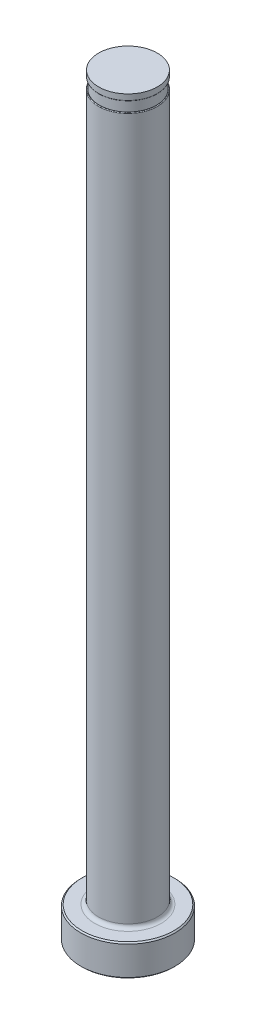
ISO-10303-21;
HEADER;
FILE_DESCRIPTION(('STEP AP214'),'2;1');
FILE_NAME('part.step','',(''),(''),'','','');
FILE_SCHEMA(('AUTOMOTIVE_DESIGN { 1 0 10303 214 1 1 1 1 }'));
ENDSEC;
DATA;
#1=APPLICATION_CONTEXT('core data for automotive mechanical design processes');
#2=APPLICATION_PROTOCOL_DEFINITION('international standard','automotive_design',2000,#1);
#3=PRODUCT_CONTEXT('',#1,'mechanical');
#4=PRODUCT('Part','Part','',(#3));
#5=PRODUCT_RELATED_PRODUCT_CATEGORY('part','',(#4));
#6=PRODUCT_DEFINITION_FORMATION('','',#4);
#7=PRODUCT_DEFINITION_CONTEXT('part definition',#1,'design');
#8=PRODUCT_DEFINITION('design','',#6,#7);
#9=PRODUCT_DEFINITION_SHAPE('','',#8);
#10=(LENGTH_UNIT() NAMED_UNIT(*) SI_UNIT(.MILLI.,.METRE.));
#11=(NAMED_UNIT(*) PLANE_ANGLE_UNIT() SI_UNIT($,.RADIAN.));
#12=(NAMED_UNIT(*) SI_UNIT($,.STERADIAN.) SOLID_ANGLE_UNIT());
#13=UNCERTAINTY_MEASURE_WITH_UNIT(LENGTH_MEASURE(1.E-05),#10,'distance_accuracy_value','');
#14=(GEOMETRIC_REPRESENTATION_CONTEXT(3) GLOBAL_UNCERTAINTY_ASSIGNED_CONTEXT((#13)) GLOBAL_UNIT_ASSIGNED_CONTEXT((#10,
#11,#12)) REPRESENTATION_CONTEXT('',''));
#15=CARTESIAN_POINT('',(0.,0.,0.));
#16=DIRECTION('',(0.,0.,1.));
#17=DIRECTION('',(1.,0.,0.));
#18=AXIS2_PLACEMENT_3D('',#15,#16,#17);
#19=CARTESIAN_POINT('',(-5.95248999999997,151.13,0.));
#20=DIRECTION('',(0.,1.,0.));
#21=DIRECTION('',(0.,0.,1.));
#22=AXIS2_PLACEMENT_3D('',#19,#20,#21);
#23=PLANE('',#22);
#24=CARTESIAN_POINT('',(0.,151.13,0.));
#25=DIRECTION('',(0.,1.,0.));
#26=DIRECTION('',(0.,0.,1.));
#27=AXIS2_PLACEMENT_3D('',#24,#25,#26);
#28=CIRCLE('',#27,5.80643999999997);
#29=CARTESIAN_POINT('',(0.,151.13,5.80643999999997));
#30=VERTEX_POINT('',#29);
#31=EDGE_CURVE('E11',#30,#30,#28,.F.);
#32=ORIENTED_EDGE('',*,*,#31,.T.);
#33=EDGE_LOOP('',(#32));
#34=FACE_BOUND('',#33,.T.);
#35=CARTESIAN_POINT('',(0.,151.13,0.));
#36=DIRECTION('',(0.,1.,0.));
#37=DIRECTION('',(0.,0.,1.));
#38=AXIS2_PLACEMENT_3D('',#35,#36,#37);
#39=CIRCLE('',#38,5.74928999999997);
#40=CARTESIAN_POINT('',(0.,151.13,5.74928999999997));
#41=VERTEX_POINT('',#40);
#42=EDGE_CURVE('E78',#41,#41,#39,.T.);
#43=ORIENTED_EDGE('',*,*,#42,.T.);
#44=EDGE_LOOP('',(#43));
#45=FACE_BOUND('',#44,.T.);
#46=ADVANCED_FACE('F36',(#34,#45),#23,.F.);
#47=CARTESIAN_POINT('',(0.,259.958771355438,0.));
#48=DIRECTION('',(0.,1.,0.));
#49=DIRECTION('',(0.,0.,1.));
#50=AXIS2_PLACEMENT_3D('',#47,#48,#49);
#51=CYLINDRICAL_SURFACE('',#50,5.95248999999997);
#52=DIRECTION('',(0.,1.,0.));
#53=VECTOR('',#52,1.);
#54=CARTESIAN_POINT('',(-5.74928999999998,259.958771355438,-1.5420122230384));
#55=LINE('',#54,#53);
#56=CARTESIAN_POINT('',(-5.74928999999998,148.971,-1.5420122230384));
#57=VERTEX_POINT('',#56);
#58=CARTESIAN_POINT('',(-5.74928999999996,86.614,-1.54201222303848));
#59=VERTEX_POINT('',#58);
#60=EDGE_CURVE('E73',#57,#59,#55,.F.);
#61=ORIENTED_EDGE('',*,*,#60,.F.);
#62=CARTESIAN_POINT('',(0.,148.971,0.));
#63=DIRECTION('',(0.,-1.,0.));
#64=DIRECTION('',(0.,0.,-1.));
#65=AXIS2_PLACEMENT_3D('',#62,#63,#64);
#66=CIRCLE('',#65,5.95248999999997);
#67=CARTESIAN_POINT('',(-5.74928999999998,148.971,1.5420122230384));
#68=VERTEX_POINT('',#67);
#69=EDGE_CURVE('E51',#57,#68,#66,.T.);
#70=ORIENTED_EDGE('',*,*,#69,.T.);
#71=DIRECTION('',(0.,1.,0.));
#72=VECTOR('',#71,1.);
#73=CARTESIAN_POINT('',(-5.74928999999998,259.958771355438,1.5420122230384));
#74=LINE('',#73,#72);
#75=CARTESIAN_POINT('',(-5.74928999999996,86.614,1.54201222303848));
#76=VERTEX_POINT('',#75);
#77=EDGE_CURVE('E84',#76,#68,#74,.T.);
#78=ORIENTED_EDGE('',*,*,#77,.F.);
#79=CARTESIAN_POINT('',(-5.74928999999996,86.614,-1.54201222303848));
#80=CARTESIAN_POINT('',(-5.7492869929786,86.5862208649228,-1.54201697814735));
#81=CARTESIAN_POINT('',(-5.74965505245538,86.5584610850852,-1.54065166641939));
#82=CARTESIAN_POINT('',(-5.75110274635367,86.5032460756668,-1.53524151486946));
#83=CARTESIAN_POINT('',(-5.75218176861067,86.4757906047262,-1.53119898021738));
#84=CARTESIAN_POINT('',(-5.75641075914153,86.3947767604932,-1.51525486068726));
#85=CARTESIAN_POINT('',(-5.76055400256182,86.3419793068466,-1.49953379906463));
#86=CARTESIAN_POINT('',(-5.77092696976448,86.2404513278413,-1.45909687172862));
#87=CARTESIAN_POINT('',(-5.77715061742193,86.191709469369,-1.43440718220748));
#88=CARTESIAN_POINT('',(-5.79098788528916,86.0989780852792,-1.37748193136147));
#89=CARTESIAN_POINT('',(-5.7986047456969,86.0550000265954,-1.34522872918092));
#90=CARTESIAN_POINT('',(-5.8168590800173,85.9601849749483,-1.26430278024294));
#91=CARTESIAN_POINT('',(-5.82772577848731,85.9111387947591,-1.21359133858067));
#92=CARTESIAN_POINT('',(-5.84932001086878,85.8219814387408,-1.10484574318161));
#93=CARTESIAN_POINT('',(-5.86004729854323,85.7818844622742,-1.0468001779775));
#94=CARTESIAN_POINT('',(-5.88390059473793,85.6979339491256,-0.904778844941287));
#95=CARTESIAN_POINT('',(-5.89659263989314,85.6574837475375,-0.818723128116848));
#96=CARTESIAN_POINT('',(-5.91855552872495,85.5905666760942,-0.641010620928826));
#97=CARTESIAN_POINT('',(-5.92782357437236,85.5641112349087,-0.549349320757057));
#98=CARTESIAN_POINT('',(-5.94230780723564,85.5236429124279,-0.360889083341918));
#99=CARTESIAN_POINT('',(-5.94742894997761,85.5099208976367,-0.26402114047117));
#100=CARTESIAN_POINT('',(-5.95288793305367,85.495318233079,-0.0691558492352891));
#101=CARTESIAN_POINT('',(-5.95322242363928,85.4944465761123,0.0288422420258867));
#102=CARTESIAN_POINT('',(-5.94868446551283,85.5065404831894,0.242237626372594));
#103=CARTESIAN_POINT('',(-5.94283113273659,85.5221121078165,0.357477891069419));
#104=CARTESIAN_POINT('',(-5.92492015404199,85.5723022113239,0.583281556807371));
#105=CARTESIAN_POINT('',(-5.91286985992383,85.6068981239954,0.693850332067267));
#106=CARTESIAN_POINT('',(-5.88892429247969,85.6822489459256,0.870563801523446));
#107=CARTESIAN_POINT('',(-5.8782833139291,85.7172292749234,0.939352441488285));
#108=CARTESIAN_POINT('',(-5.85581507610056,85.7974071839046,1.07049428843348));
#109=CARTESIAN_POINT('',(-5.84398982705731,85.8425876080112,1.13285804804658));
#110=CARTESIAN_POINT('',(-5.82307219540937,85.9323208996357,1.23534317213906));
#111=CARTESIAN_POINT('',(-5.81396107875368,85.97474672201,1.27731748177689));
#112=CARTESIAN_POINT('',(-5.79660025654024,86.0659777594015,1.35392068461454));
#113=CARTESIAN_POINT('',(-5.78834968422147,86.1147764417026,1.38855700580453));
#114=CARTESIAN_POINT('',(-5.77487399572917,86.2094137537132,1.4434795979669));
#115=CARTESIAN_POINT('',(-5.76937362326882,86.2543804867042,1.46519744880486));
#116=CARTESIAN_POINT('',(-5.76015985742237,86.3473997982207,1.50101335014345));
#117=CARTESIAN_POINT('',(-5.75644319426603,86.3954465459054,1.51512534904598));
#118=CARTESIAN_POINT('',(-5.75233279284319,86.4722424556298,1.53063311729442));
#119=CARTESIAN_POINT('',(-5.75119737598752,86.500400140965,1.53488770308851));
#120=CARTESIAN_POINT('',(-5.74967384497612,86.5570323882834,1.54058135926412));
#121=CARTESIAN_POINT('',(-5.74928611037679,86.5855071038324,1.54201899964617));
#122=CARTESIAN_POINT('',(-5.74928999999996,86.614,1.54201222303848));
#123=B_SPLINE_CURVE_WITH_KNOTS('',3,(#79,#80,#81,#82,#83,#84,#85,#86,#87,#88,#89,#90,#91,#92,
#93,#94,#95,#96,#97,#98,#99,#100,#101,#102,#103,#104,#105,#106,#107,#108,#109,#110,#111,#112,
#113,#114,#115,#116,#117,#118,#119,#120,#121,#122),.UNSPECIFIED.,.F.,.F.,(4,2,2,2,2,2,2,2,2,2,2,
2,2,2,2,2,2,2,2,2,2,4),(0.,0.0832648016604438,0.166458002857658,0.331100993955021,
0.495267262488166,0.659820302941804,0.872804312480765,1.08612389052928,1.37238232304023,
1.65887416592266,1.95175985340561,2.2448504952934,2.59250114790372,2.93974031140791,
3.17269488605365,3.4052605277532,3.58572381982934,3.76600355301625,3.91610532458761,
4.0659308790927,4.15129340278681,4.23669924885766),.UNSPECIFIED.);
#124=EDGE_CURVE('E81',#59,#76,#123,.T.);
#125=ORIENTED_EDGE('',*,*,#124,.F.);
#126=EDGE_LOOP('',(#61,#70,#78,#125));
#127=FACE_BOUND('',#126,.T.);
#128=CARTESIAN_POINT('',(0.,7.11200000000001,0.));
#129=DIRECTION('',(0.,1.,0.));
#130=DIRECTION('',(0.,0.,1.));
#131=AXIS2_PLACEMENT_3D('',#128,#129,#130);
#132=CIRCLE('',#131,5.95248999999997);
#133=CARTESIAN_POINT('',(0.,7.11200000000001,5.95248999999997));
#134=VERTEX_POINT('',#133);
#135=EDGE_CURVE('E116',#134,#134,#132,.T.);
#136=ORIENTED_EDGE('',*,*,#135,.T.);
#137=EDGE_LOOP('',(#136));
#138=FACE_BOUND('',#137,.T.);
#139=ADVANCED_FACE('F82',(#127,#138),#51,.T.);
#140=CARTESIAN_POINT('',(0.,0.,0.));
#141=DIRECTION('',(0.,-1.,0.));
#142=DIRECTION('',(0.,0.,-1.));
#143=AXIS2_PLACEMENT_3D('',#140,#141,#142);
#144=PLANE('',#143);
#145=CARTESIAN_POINT('',(0.,0.,0.));
#146=DIRECTION('',(0.,-1.,0.));
#147=DIRECTION('',(0.,0.,-1.));
#148=AXIS2_PLACEMENT_3D('',#145,#146,#147);
#149=CIRCLE('',#148,9.271);
#150=CARTESIAN_POINT('',(0.,0.,-9.271));
#151=VERTEX_POINT('',#150);
#152=EDGE_CURVE('E113',#151,#151,#149,.T.);
#153=ORIENTED_EDGE('',*,*,#152,.T.);
#154=EDGE_LOOP('',(#153));
#155=FACE_BOUND('',#154,.T.);
#156=ADVANCED_FACE('F192',(#155),#144,.T.);
#157=CARTESIAN_POINT('',(0.,259.958771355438,0.));
#158=DIRECTION('',(0.,1.,0.));
#159=DIRECTION('',(0.,0.,1.));
#160=AXIS2_PLACEMENT_3D('',#157,#158,#159);
#161=CYLINDRICAL_SURFACE('',#160,9.52499999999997);
#162=CARTESIAN_POINT('',(0.,6.09600000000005,0.));
#163=DIRECTION('',(0.,1.,0.));
#164=DIRECTION('',(0.,0.,1.));
#165=AXIS2_PLACEMENT_3D('',#162,#163,#164);
#166=CIRCLE('',#165,9.52499999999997);
#167=CARTESIAN_POINT('',(0.,6.09600000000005,9.52499999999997));
#168=VERTEX_POINT('',#167);
#169=EDGE_CURVE('E110',#168,#168,#166,.F.);
#170=ORIENTED_EDGE('',*,*,#169,.T.);
#171=EDGE_LOOP('',(#170));
#172=FACE_BOUND('',#171,.T.);
#173=CARTESIAN_POINT('',(0.,0.253999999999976,0.));
#174=DIRECTION('',(0.,-1.,0.));
#175=DIRECTION('',(0.,0.,-1.));
#176=AXIS2_PLACEMENT_3D('',#173,#174,#175);
#177=CIRCLE('',#176,9.52499999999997);
#178=CARTESIAN_POINT('',(0.,0.253999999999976,-9.52499999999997));
#179=VERTEX_POINT('',#178);
#180=EDGE_CURVE('E107',#179,#179,#177,.F.);
#181=ORIENTED_EDGE('',*,*,#180,.T.);
#182=EDGE_LOOP('',(#181));
#183=FACE_BOUND('',#182,.T.);
#184=ADVANCED_FACE('F195',(#172,#183),#161,.T.);
#185=CARTESIAN_POINT('',(-9.52499999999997,6.35,0.));
#186=DIRECTION('',(0.,1.,0.));
#187=DIRECTION('',(0.,0.,1.));
#188=AXIS2_PLACEMENT_3D('',#185,#186,#187);
#189=PLANE('',#188);
#190=CARTESIAN_POINT('',(0.,6.35,0.));
#191=DIRECTION('',(0.,1.,0.));
#192=DIRECTION('',(0.,0.,1.));
#193=AXIS2_PLACEMENT_3D('',#190,#191,#192);
#194=CIRCLE('',#193,6.71448999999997);
#195=CARTESIAN_POINT('',(0.,6.35,6.71448999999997));
#196=VERTEX_POINT('',#195);
#197=EDGE_CURVE('E87',#196,#196,#194,.F.);
#198=ORIENTED_EDGE('',*,*,#197,.T.);
#199=EDGE_LOOP('',(#198));
#200=FACE_BOUND('',#199,.T.);
#201=CARTESIAN_POINT('',(0.,6.35,0.));
#202=DIRECTION('',(0.,1.,0.));
#203=DIRECTION('',(0.,0.,1.));
#204=AXIS2_PLACEMENT_3D('',#201,#202,#203);
#205=CIRCLE('',#204,9.27100000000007);
#206=CARTESIAN_POINT('',(0.,6.35,9.27100000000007));
#207=VERTEX_POINT('',#206);
#208=EDGE_CURVE('E104',#207,#207,#205,.T.);
#209=ORIENTED_EDGE('',*,*,#208,.T.);
#210=EDGE_LOOP('',(#209));
#211=FACE_BOUND('',#210,.T.);
#212=ADVANCED_FACE('F190',(#200,#211),#189,.T.);
#213=CARTESIAN_POINT('',(0.,6.35000000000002,0.));
#214=DIRECTION('',(0.,-1.,0.));
#215=DIRECTION('',(0.,0.,-1.));
#216=AXIS2_PLACEMENT_3D('',#213,#214,#215);
#217=CONICAL_SURFACE('',#216,9.27100000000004,0.785398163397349);
#218=ORIENTED_EDGE('',*,*,#169,.F.);
#219=EDGE_LOOP('',(#218));
#220=FACE_BOUND('',#219,.T.);
#221=ORIENTED_EDGE('',*,*,#208,.F.);
#222=EDGE_LOOP('',(#221));
#223=FACE_BOUND('',#222,.T.);
#224=ADVANCED_FACE('F186',(#220,#223),#217,.T.);
#225=CARTESIAN_POINT('',(0.,0.253999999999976,0.));
#226=DIRECTION('',(0.,1.,0.));
#227=DIRECTION('',(0.,0.,1.));
#228=AXIS2_PLACEMENT_3D('',#225,#226,#227);
#229=CONICAL_SURFACE('',#228,9.52499999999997,0.785398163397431);
#230=ORIENTED_EDGE('',*,*,#152,.F.);
#231=EDGE_LOOP('',(#230));
#232=FACE_BOUND('',#231,.T.);
#233=ORIENTED_EDGE('',*,*,#180,.F.);
#234=EDGE_LOOP('',(#233));
#235=FACE_BOUND('',#234,.T.);
#236=ADVANCED_FACE('F182',(#232,#235),#229,.T.);
#237=CARTESIAN_POINT('',(0.,7.11200000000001,0.));
#238=DIRECTION('',(0.,1.,0.));
#239=DIRECTION('',(0.,0.,1.));
#240=AXIS2_PLACEMENT_3D('',#237,#238,#239);
#241=TOROIDAL_SURFACE('',#240,6.71448999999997,0.762);
#242=ORIENTED_EDGE('',*,*,#197,.F.);
#243=EDGE_LOOP('',(#242));
#244=FACE_BOUND('',#243,.T.);
#245=ORIENTED_EDGE('',*,*,#135,.F.);
#246=EDGE_LOOP('',(#245));
#247=FACE_BOUND('',#246,.T.);
#248=ADVANCED_FACE('F147',(#244,#247),#241,.F.);
#249=CARTESIAN_POINT('',(-5.95248999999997,149.098,0.));
#250=DIRECTION('',(0.,-1.,0.));
#251=DIRECTION('',(0.,0.,-1.));
#252=AXIS2_PLACEMENT_3D('',#249,#250,#251);
#253=PLANE('',#252);
#254=DIRECTION('',(0.,0.,1.));
#255=VECTOR('',#254,1.);
#256=CARTESIAN_POINT('',(-5.74928999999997,149.098,0.));
#257=LINE('',#256,#255);
#258=CARTESIAN_POINT('',(-5.74928999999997,149.098,0.));
#259=VERTEX_POINT('',#258);
#260=CARTESIAN_POINT('',(-5.74928999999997,149.098,0.939147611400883));
#261=VERTEX_POINT('',#260);
#262=EDGE_CURVE('E90',#259,#261,#257,.T.);
#263=ORIENTED_EDGE('',*,*,#262,.T.);
#264=CARTESIAN_POINT('',(0.,149.098,0.));
#265=DIRECTION('',(0.,-1.,0.));
#266=DIRECTION('',(0.,0.,-1.));
#267=AXIS2_PLACEMENT_3D('',#264,#265,#266);
#268=CIRCLE('',#267,5.82548999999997);
#269=CARTESIAN_POINT('',(-5.74928999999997,149.098,-0.939147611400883));
#270=VERTEX_POINT('',#269);
#271=EDGE_CURVE('E86',#261,#270,#268,.F.);
#272=ORIENTED_EDGE('',*,*,#271,.T.);
#273=EDGE_CURVE('E79',#270,#259,#257,.T.);
#274=ORIENTED_EDGE('',*,*,#273,.T.);
#275=CARTESIAN_POINT('',(0.,149.098,0.));
#276=DIRECTION('',(0.,1.,0.));
#277=DIRECTION('',(0.,0.,1.));
#278=AXIS2_PLACEMENT_3D('',#275,#276,#277);
#279=CIRCLE('',#278,5.74928999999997);
#280=EDGE_CURVE('E101',#259,#259,#279,.T.);
#281=ORIENTED_EDGE('',*,*,#280,.F.);
#282=EDGE_LOOP('',(#263,#272,#274,#281));
#283=FACE_BOUND('',#282,.T.);
#284=ADVANCED_FACE('F144',(#283),#253,.F.);
#285=CARTESIAN_POINT('',(0.,153.448281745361,0.));
#286=DIRECTION('',(0.,1.,0.));
#287=DIRECTION('',(0.,0.,1.));
#288=AXIS2_PLACEMENT_3D('',#285,#286,#287);
#289=CYLINDRICAL_SURFACE('',#288,5.74928999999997);
#290=ORIENTED_EDGE('',*,*,#42,.F.);
#291=EDGE_LOOP('',(#290));
#292=FACE_BOUND('',#291,.T.);
#293=ORIENTED_EDGE('',*,*,#280,.T.);
#294=EDGE_LOOP('',(#293));
#295=FACE_BOUND('',#294,.T.);
#296=ADVANCED_FACE('F141',(#292,#295),#289,.T.);
#297=CARTESIAN_POINT('',(-5.74928999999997,150.114,-9.52499999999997));
#298=DIRECTION('',(1.,0.,0.));
#299=DIRECTION('',(0.,1.,0.));
#300=AXIS2_PLACEMENT_3D('',#297,#298,#299);
#301=PLANE('',#300);
#302=ORIENTED_EDGE('',*,*,#273,.F.);
#303=CARTESIAN_POINT('',(-5.74928999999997,149.098,-0.939147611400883));
#304=CARTESIAN_POINT('',(-5.74928999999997,149.097999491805,-0.960313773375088));
#305=CARTESIAN_POINT('',(-5.74928999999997,149.097863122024,-0.981479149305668));
#306=CARTESIAN_POINT('',(-5.74928999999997,149.097255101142,-1.02381131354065));
#307=CARTESIAN_POINT('',(-5.74928999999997,149.096783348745,-1.0449781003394));
#308=CARTESIAN_POINT('',(-5.74928999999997,149.094768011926,-1.10851964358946));
#309=CARTESIAN_POINT('',(-5.74928999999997,149.092624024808,-1.15088175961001));
#310=CARTESIAN_POINT('',(-5.74928999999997,149.087688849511,-1.21286687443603));
#311=CARTESIAN_POINT('',(-5.74928999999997,149.085853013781,-1.23256518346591));
#312=CARTESIAN_POINT('',(-5.74928999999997,149.081501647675,-1.27188290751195));
#313=CARTESIAN_POINT('',(-5.74928999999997,149.078986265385,-1.29150233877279));
#314=CARTESIAN_POINT('',(-5.74928999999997,149.071966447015,-1.33801228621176));
#315=CARTESIAN_POINT('',(-5.74928999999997,149.067069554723,-1.36484781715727));
#316=CARTESIAN_POINT('',(-5.74928999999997,149.056495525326,-1.40986464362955));
#317=CARTESIAN_POINT('',(-5.74928999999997,149.051508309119,-1.4281964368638));
#318=CARTESIAN_POINT('',(-5.74928999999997,149.042514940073,-1.45484549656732));
#319=CARTESIAN_POINT('',(-5.74928999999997,149.039335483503,-1.46343850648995));
#320=CARTESIAN_POINT('',(-5.74928999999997,149.03227591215,-1.48034059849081));
#321=CARTESIAN_POINT('',(-5.74928999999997,149.028396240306,-1.48864985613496));
#322=CARTESIAN_POINT('',(-5.74928999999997,149.021506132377,-1.50120056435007));
#323=CARTESIAN_POINT('',(-5.74928999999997,149.018853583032,-1.5056368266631));
#324=CARTESIAN_POINT('',(-5.74928999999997,149.013101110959,-1.51421595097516));
#325=CARTESIAN_POINT('',(-5.74928999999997,149.01000162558,-1.51835909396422));
#326=CARTESIAN_POINT('',(-5.74928999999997,149.004471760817,-1.52466635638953));
#327=CARTESIAN_POINT('',(-5.74928999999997,149.00222570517,-1.52699040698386));
#328=CARTESIAN_POINT('',(-5.74928999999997,148.997445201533,-1.53132640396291));
#329=CARTESIAN_POINT('',(-5.74928999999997,148.994911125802,-1.53333874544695));
#330=CARTESIAN_POINT('',(-5.74928999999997,148.990334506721,-1.53634422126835));
#331=CARTESIAN_POINT('',(-5.74928999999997,148.988374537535,-1.53746164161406));
#332=CARTESIAN_POINT('',(-5.74928999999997,148.984307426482,-1.53937528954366));
#333=CARTESIAN_POINT('',(-5.74928999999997,148.982200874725,-1.54017272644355));
#334=CARTESIAN_POINT('',(-5.74928999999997,148.9785728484,-1.54117250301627));
#335=CARTESIAN_POINT('',(-5.74928999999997,148.977081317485,-1.54148377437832));
#336=CARTESIAN_POINT('',(-5.74928999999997,148.974060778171,-1.54190531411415));
#337=CARTESIAN_POINT('',(-5.74928999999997,148.972531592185,-1.5420142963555));
#338=CARTESIAN_POINT('',(-5.74928999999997,148.971000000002,-1.54201222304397));
#339=B_SPLINE_CURVE_WITH_KNOTS('',3,(#303,#304,#305,#306,#307,#308,#309,#310,#311,#312,#313,
#314,#315,#316,#317,#318,#319,#320,#321,#322,#323,#324,#325,#326,#327,#328,#329,#330,#331,#332,
#333,#334,#335,#336,#337,#338),.UNSPECIFIED.,.F.,.F.,(4,2,2,2,2,2,2,2,2,2,2,2,2,2,2,2,2,4),(0.,
0.0634959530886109,0.127011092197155,0.254202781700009,0.313544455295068,0.372873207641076,
0.454629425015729,0.511527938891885,0.538997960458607,0.566450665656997,0.581940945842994,
0.597416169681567,0.607094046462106,0.616759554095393,0.62350701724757,0.630228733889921,
0.634786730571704,0.639373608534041),.UNSPECIFIED.);
#340=EDGE_CURVE('E59',#270,#57,#339,.T.);
#341=ORIENTED_EDGE('',*,*,#340,.T.);
#342=ORIENTED_EDGE('',*,*,#60,.T.);
#343=DIRECTION('',(0.,0.,1.));
#344=VECTOR('',#343,1.);
#345=CARTESIAN_POINT('',(-5.74928999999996,86.614,-9.52499999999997));
#346=LINE('',#345,#344);
#347=EDGE_CURVE('E77',#59,#76,#346,.T.);
#348=ORIENTED_EDGE('',*,*,#347,.T.);
#349=ORIENTED_EDGE('',*,*,#77,.T.);
#350=CARTESIAN_POINT('',(-5.74928999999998,148.971,1.5420122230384));
#351=CARTESIAN_POINT('',(-5.74928999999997,148.973261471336,1.54202038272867));
#352=CARTESIAN_POINT('',(-5.74928999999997,148.975510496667,1.54177946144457));
#353=CARTESIAN_POINT('',(-5.74928999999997,148.979887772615,1.54087970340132));
#354=CARTESIAN_POINT('',(-5.74928999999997,148.982017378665,1.54022760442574));
#355=CARTESIAN_POINT('',(-5.74928999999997,148.986617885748,1.53838865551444));
#356=CARTESIAN_POINT('',(-5.74928999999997,148.989052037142,1.53711237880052));
#357=CARTESIAN_POINT('',(-5.74928999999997,148.993698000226,1.53418694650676));
#358=CARTESIAN_POINT('',(-5.74928999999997,148.995908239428,1.53253538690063));
#359=CARTESIAN_POINT('',(-5.74928999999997,149.001730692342,1.52761233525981));
#360=CARTESIAN_POINT('',(-5.74928999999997,149.005112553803,1.5240724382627));
#361=CARTESIAN_POINT('',(-5.74928999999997,149.011360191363,1.51657566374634));
#362=CARTESIAN_POINT('',(-5.74928999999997,149.01422496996,1.5126180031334));
#363=CARTESIAN_POINT('',(-5.74928999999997,149.021008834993,1.50226117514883));
#364=CARTESIAN_POINT('',(-5.74928999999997,149.024667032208,1.49569302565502));
#365=CARTESIAN_POINT('',(-5.74928999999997,149.031372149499,1.48224724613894));
#366=CARTESIAN_POINT('',(-5.74928999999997,149.034417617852,1.47536892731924));
#367=CARTESIAN_POINT('',(-5.74928999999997,149.042912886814,1.45440029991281));
#368=CARTESIAN_POINT('',(-5.74928999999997,149.047686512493,1.44003865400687));
#369=CARTESIAN_POINT('',(-5.74928999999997,149.056114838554,1.41106200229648));
#370=CARTESIAN_POINT('',(-5.74928999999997,149.059772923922,1.39644790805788));
#371=CARTESIAN_POINT('',(-5.74928999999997,149.066305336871,1.36704254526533));
#372=CARTESIAN_POINT('',(-5.74928999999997,149.069179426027,1.35225122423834));
#373=CARTESIAN_POINT('',(-5.74928999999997,149.076936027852,1.30765909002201));
#374=CARTESIAN_POINT('',(-5.74928999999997,149.080935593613,1.27770752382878));
#375=CARTESIAN_POINT('',(-5.74928999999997,149.087413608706,1.21764271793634));
#376=CARTESIAN_POINT('',(-5.74928999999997,149.089891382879,1.18752941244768));
#377=CARTESIAN_POINT('',(-5.74928999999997,149.09374393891,1.12726865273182));
#378=CARTESIAN_POINT('',(-5.74928999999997,149.095119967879,1.09712127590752));
#379=CARTESIAN_POINT('',(-5.74928999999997,149.096769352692,1.04562383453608));
#380=CARTESIAN_POINT('',(-5.74928999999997,149.097247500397,1.02427949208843));
#381=CARTESIAN_POINT('',(-5.74928999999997,149.097861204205,0.98167241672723));
#382=CARTESIAN_POINT('',(-5.74928999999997,149.097998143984,0.960409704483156));
#383=CARTESIAN_POINT('',(-5.74928999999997,149.098,0.939147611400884));
#384=B_SPLINE_CURVE_WITH_KNOTS('',3,(#350,#351,#352,#353,#354,#355,#356,#357,#358,#359,#360,
#361,#362,#363,#364,#365,#366,#367,#368,#369,#370,#371,#372,#373,#374,#375,#376,#377,#378,#379,
#380,#381,#382,#383),.UNSPECIFIED.,.F.,.F.,(4,2,2,2,2,2,2,2,2,2,2,2,2,2,2,2,4),(0.,
0.00675172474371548,0.0133955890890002,0.0215941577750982,0.0298468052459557,0.0444516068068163,
0.0590842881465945,0.0815815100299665,0.104131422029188,0.149443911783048,0.19461750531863,
0.239804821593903,0.330387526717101,0.421010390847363,0.51153052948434,0.57557722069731,
0.639363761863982),.UNSPECIFIED.);
#385=EDGE_CURVE('E172',#68,#261,#384,.T.);
#386=ORIENTED_EDGE('',*,*,#385,.T.);
#387=ORIENTED_EDGE('',*,*,#262,.F.);
#388=EDGE_LOOP('',(#302,#341,#342,#348,#349,#386,#387));
#389=FACE_BOUND('',#388,.T.);
#390=ADVANCED_FACE('F75',(#389),#301,.F.);
#391=CARTESIAN_POINT('',(-8.92428999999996,86.614,-9.52499999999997));
#392=DIRECTION('',(0.,0.,1.));
#393=DIRECTION('',(1.,0.,0.));
#394=AXIS2_PLACEMENT_3D('',#391,#392,#393);
#395=CYLINDRICAL_SURFACE('',#394,3.175);
#396=ORIENTED_EDGE('',*,*,#347,.F.);
#397=ORIENTED_EDGE('',*,*,#124,.T.);
#398=EDGE_LOOP('',(#396,#397));
#399=FACE_BOUND('',#398,.T.);
#400=ADVANCED_FACE('F89',(#399),#395,.F.);
#401=CARTESIAN_POINT('',(0.,152.687735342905,0.));
#402=DIRECTION('',(0.,1.,0.));
#403=DIRECTION('',(0.,0.,1.));
#404=AXIS2_PLACEMENT_3D('',#401,#402,#403);
#405=CYLINDRICAL_SURFACE('',#404,5.93343999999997);
#406=CARTESIAN_POINT('',(0.,151.257,0.));
#407=DIRECTION('',(0.,1.,0.));
#408=DIRECTION('',(0.,0.,1.));
#409=AXIS2_PLACEMENT_3D('',#406,#407,#408);
#410=CIRCLE('',#409,5.93343999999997);
#411=CARTESIAN_POINT('',(0.,151.257,5.93343999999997));
#412=VERTEX_POINT('',#411);
#413=EDGE_CURVE('E44',#412,#412,#410,.T.);
#414=ORIENTED_EDGE('',*,*,#413,.T.);
#415=EDGE_LOOP('',(#414));
#416=FACE_BOUND('',#415,.T.);
#417=CARTESIAN_POINT('',(0.,152.4,0.));
#418=DIRECTION('',(0.,1.,0.));
#419=DIRECTION('',(0.,0.,1.));
#420=AXIS2_PLACEMENT_3D('',#417,#418,#419);
#421=CIRCLE('',#420,5.93343999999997);
#422=CARTESIAN_POINT('',(0.,152.4,5.93343999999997));
#423=VERTEX_POINT('',#422);
#424=EDGE_CURVE('E91',#423,#423,#421,.T.);
#425=ORIENTED_EDGE('',*,*,#424,.F.);
#426=EDGE_LOOP('',(#425));
#427=FACE_BOUND('',#426,.T.);
#428=ADVANCED_FACE('F135',(#416,#427),#405,.T.);
#429=CARTESIAN_POINT('',(-5.95248999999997,152.4,0.));
#430=DIRECTION('',(0.,1.,0.));
#431=DIRECTION('',(0.,0.,1.));
#432=AXIS2_PLACEMENT_3D('',#429,#430,#431);
#433=PLANE('',#432);
#434=ORIENTED_EDGE('',*,*,#424,.T.);
#435=EDGE_LOOP('',(#434));
#436=FACE_BOUND('',#435,.T.);
#437=ADVANCED_FACE('F149',(#436),#433,.T.);
#438=CARTESIAN_POINT('',(0.,148.971,0.));
#439=DIRECTION('',(0.,-1.,0.));
#440=DIRECTION('',(0.,0.,-1.));
#441=AXIS2_PLACEMENT_3D('',#438,#439,#440);
#442=TOROIDAL_SURFACE('',#441,5.82548999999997,0.127);
#443=ORIENTED_EDGE('',*,*,#385,.F.);
#444=ORIENTED_EDGE('',*,*,#69,.F.);
#445=ORIENTED_EDGE('',*,*,#340,.F.);
#446=ORIENTED_EDGE('',*,*,#271,.F.);
#447=EDGE_LOOP('',(#443,#444,#445,#446));
#448=FACE_BOUND('',#447,.T.);
#449=ADVANCED_FACE('F151',(#448),#442,.T.);
#450=CARTESIAN_POINT('',(0.,151.257,0.));
#451=DIRECTION('',(0.,1.,0.));
#452=DIRECTION('',(0.,0.,1.));
#453=AXIS2_PLACEMENT_3D('',#450,#451,#452);
#454=TOROIDAL_SURFACE('',#453,5.80643999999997,0.127);
#455=ORIENTED_EDGE('',*,*,#31,.F.);
#456=EDGE_LOOP('',(#455));
#457=FACE_BOUND('',#456,.T.);
#458=ORIENTED_EDGE('',*,*,#413,.F.);
#459=EDGE_LOOP('',(#458));
#460=FACE_BOUND('',#459,.T.);
#461=ADVANCED_FACE('F38',(#457,#460),#454,.T.);
#462=CLOSED_SHELL('',(#46,#139,#156,#184,#212,#224,#236,#248,#284,#296,#390,#400,#428,#437,#449,#461));
#463=MANIFOLD_SOLID_BREP('B2',#462);
#464=ADVANCED_BREP_SHAPE_REPRESENTATION('',(#18,#463),#14);
#465=SHAPE_DEFINITION_REPRESENTATION(#9,#464);
ENDSEC;
END-ISO-10303-21;
